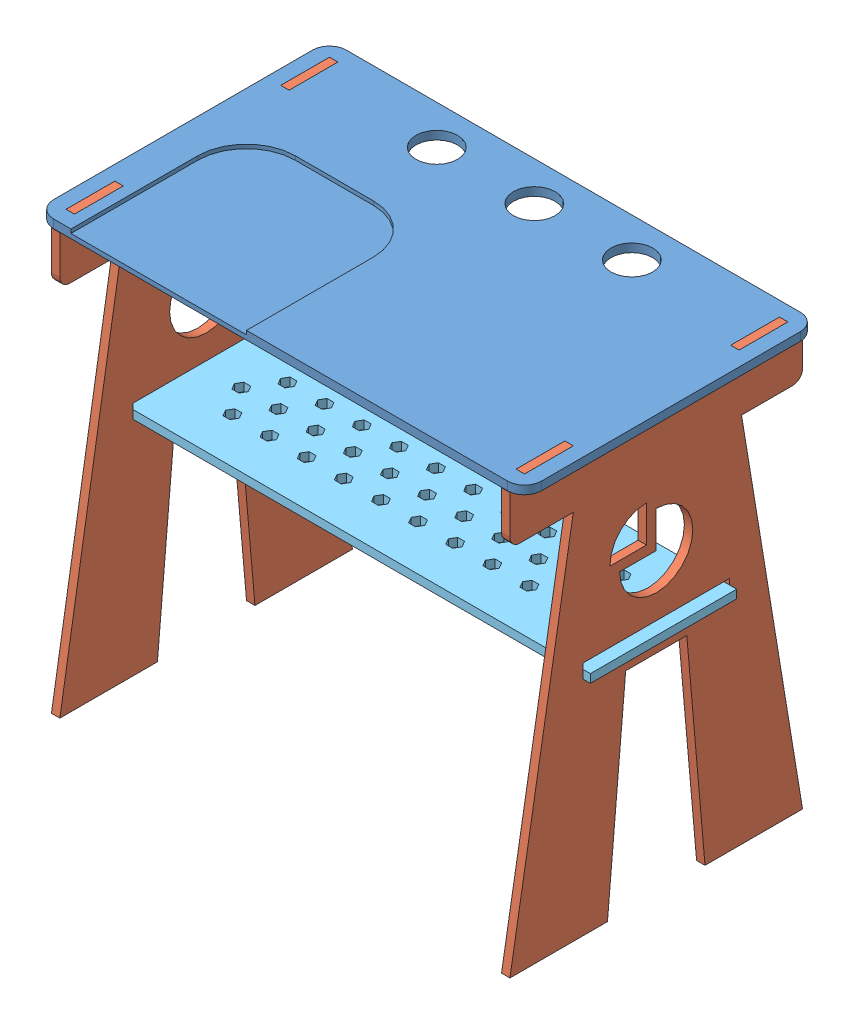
SolidWorks assembly PizzaAssembly.SLDASM, configuration Default (file format 7000). Lengths in mm.
Overall size (1000 880 600).
9 component instances, 5 part files, 22 mates.
Components (placement in the parent):
- Pizza Top-2: Pizza Top.SLDPRT [Default] at origin size (1000 17.25 600)
- Pizza Leg-3: Pizza Leg.SLDPRT [Default] at (-470 -0.75 219.6296) size (17.25 880 600)
- Support-3: Support.SLDPRT [Default] at (0.75 -50 117.25) x (0 0 -1) z (1 0 0) size (17.25 100 932)
- Support-4: Support.SLDPRT [Default] at (0.75 -50 -117.25) x (0 0 1) z (-1 0 0) size (17.25 100 932)
- Pizza Leg-5: Pizza Leg.SLDPRT [Default] at (470 -0.75 -219.6296) x (-1 0 0) z (0 0 -1) size (17.25 880 600)
- SideBracket-7: SideBracket.SLDPRT [Default] at (-7.875 -50 0) size (17.25 100 300)
- SideBracket-8: SideBracket.SLDPRT [Default] at (-307.875 -50 0) size (17.25 100 300)
- SideBracket-9: SideBracket.SLDPRT [Default] at (292.125 -50 0) size (17.25 100 300)
- Shelf-1: Shelf.SLDPRT [Default] at (0 -398.3845 0) x (0 0 1) z (-1 0 0) size (300 17.25 970)
Mates (geometry in assembly coordinates):
- Coincident1: coincident: line of Pizza Top-2 through (-470 17.25 170) axis (0 0 1); line of Pizza Leg-3 through (-470 17.25 170) axis (0 0 1)
- Coincident2: coincident: line of Pizza Top-2 through (-470 17.25 270) axis (1 0 0); line of Pizza Leg-3 through (-452.75 17.25 270) axis (-1 0 0)
- Coincident5: coincident: line of Pizza Top-2 through (452.75 17.25 -270) axis (0 0 1); line of Pizza Leg-5 through (452.75 17.25 -170) axis (0 0 -1)
- Coincident6: coincident: line of Pizza Top-2 through (470 17.25 -270) axis (-1 0 0); line of Pizza Leg-5 through (452.75 17.25 -270) axis (1 0 0)
- Coincident10: coincident: line of Support-4 through (466.75 -100 -117.25) axis (0 1 0); line of Pizza Leg-5 through (466.75 -5.75 -117.25) axis (0 -1 0)
- Coincident11: coincident: plane of Pizza Top-2 through (0 0 0) normal (0 -1 0); plane of Support-4 through (-465.25 0 -100) normal (0 1 0)
- Parallel1: parallel: plane of Pizza Leg-3 through (-466.75 -0.75 219.6296) normal (1 0 0); plane of Support-4 through (-465.25 -100 -100) normal (-1 0 0)
- Coincident13: coincident: plane of Pizza Top-2 through (0 0 0) normal (0 -1 0); plane of Support-3 through (466.75 0 100) normal (0 1 0)
- Coincident14: coincident: plane of Support-3 through (466.75 -100 100) normal (1 0 0); plane of Pizza Leg-5 through (466.75 -0.75 -219.6296) normal (-1 0 0)
- Coincident15: coincident: line of Support-3 through (466.75 0 100) axis (0 -1 0); line of Pizza Leg-5 through (466.75 -5.75 100) axis (0 -1 0)
- Coincident16: coincident: plane of Pizza Top-2 through (0 0 0) normal (0 -1 0); plane of SideBracket-8 through (-290.625 0 150) normal (0 1 0)
- Coincident20: coincident: line of Support-3 through (-307.875 -50 117.25) axis (1 0 0); line of SideBracket-8 through (-307.875 -50 117.25) axis (1 0 0)
- Coincident21: coincident: plane of Support-3 through (-307.875 -50 118) normal (1 0 0); plane of SideBracket-8 through (-307.875 -50 0) normal (-1 0 0)
- Coincident22: coincident: plane of Support-3 through (9.375 -50 118) normal (-1 0 0); plane of SideBracket-7 through (9.375 -50 0) normal (1 0 0)
- Coincident23: coincident: plane of Pizza Top-2 through (0 0 0) normal (0 -1 0); plane of SideBracket-7 through (9.375 0 150) normal (0 1 0)
- Coincident24: coincident: line of Support-3 through (9.375 -50 100) axis (-1 0 0); line of SideBracket-7 through (-7.875 -50 100) axis (1 0 0)
- Coincident25: coincident: plane of Pizza Top-2 through (0 0 0) normal (0 -1 0); plane of SideBracket-9 through (309.375 0 150) normal (0 1 0)
- Coincident26: coincident: plane of Support-3 through (309.375 -50 118) normal (-1 0 0); plane of SideBracket-9 through (309.375 -50 0) normal (1 0 0)
- Coincident28: coincident: line of Support-3 through (292.125 -50 117.25) axis (0 1 0); line of SideBracket-9 through (292.125 -50 117.25) axis (0 -1 0)
- Coincident29: coincident: plane of Pizza Leg-3 through (-470 -398.3845 219.6296) normal (0 1 0); plane of Shelf-1 through (0 -398.3845 -150) normal (0 -1 0)
- Coincident30: coincident: line of Pizza Leg-3 through (-470 -398.3845 150) axis (0 0 -1); line of Shelf-1 through (-470 -398.3845 -150) axis (0 0 1)
- Coincident31: coincident: plane of Pizza Leg-3 through (-470 -0.75 150) normal (0 0 -1); plane of Shelf-1 through (0 -398.3845 150) normal (0 0 1)
